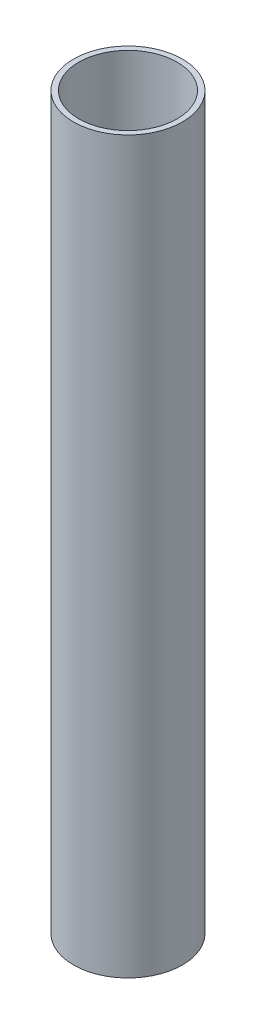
ISO-10303-21;
HEADER;
FILE_DESCRIPTION(('STEP AP214'),'2;1');
FILE_NAME('part.step','',(''),(''),'','','');
FILE_SCHEMA(('AUTOMOTIVE_DESIGN { 1 0 10303 214 1 1 1 1 }'));
ENDSEC;
DATA;
#1=APPLICATION_CONTEXT('core data for automotive mechanical design processes');
#2=APPLICATION_PROTOCOL_DEFINITION('international standard','automotive_design',2000,#1);
#3=PRODUCT_CONTEXT('',#1,'mechanical');
#4=PRODUCT('Part','Part','',(#3));
#5=PRODUCT_RELATED_PRODUCT_CATEGORY('part','',(#4));
#6=PRODUCT_DEFINITION_FORMATION('','',#4);
#7=PRODUCT_DEFINITION_CONTEXT('part definition',#1,'design');
#8=PRODUCT_DEFINITION('design','',#6,#7);
#9=PRODUCT_DEFINITION_SHAPE('','',#8);
#10=(LENGTH_UNIT() NAMED_UNIT(*) SI_UNIT(.MILLI.,.METRE.));
#11=(NAMED_UNIT(*) PLANE_ANGLE_UNIT() SI_UNIT($,.RADIAN.));
#12=(NAMED_UNIT(*) SI_UNIT($,.STERADIAN.) SOLID_ANGLE_UNIT());
#13=UNCERTAINTY_MEASURE_WITH_UNIT(LENGTH_MEASURE(1.E-05),#10,'distance_accuracy_value','');
#14=(GEOMETRIC_REPRESENTATION_CONTEXT(3) GLOBAL_UNCERTAINTY_ASSIGNED_CONTEXT((#13)) GLOBAL_UNIT_ASSIGNED_CONTEXT((#10,
#11,#12)) REPRESENTATION_CONTEXT('',''));
#15=CARTESIAN_POINT('',(0.,0.,0.));
#16=DIRECTION('',(0.,0.,1.));
#17=DIRECTION('',(1.,0.,0.));
#18=AXIS2_PLACEMENT_3D('',#15,#16,#17);
#19=CARTESIAN_POINT('',(0.,215.9,0.));
#20=DIRECTION('',(0.,1.,0.));
#21=DIRECTION('',(0.,0.,1.));
#22=AXIS2_PLACEMENT_3D('',#19,#20,#21);
#23=PLANE('',#22);
#24=CARTESIAN_POINT('',(0.,215.9,0.));
#25=DIRECTION('',(0.,1.,0.));
#26=DIRECTION('',(0.,0.,1.));
#27=AXIS2_PLACEMENT_3D('',#24,#25,#26);
#28=CIRCLE('',#27,16.1163);
#29=CARTESIAN_POINT('',(0.,215.9,16.1163));
#30=VERTEX_POINT('',#29);
#31=EDGE_CURVE('E11',#30,#30,#28,.T.);
#32=ORIENTED_EDGE('',*,*,#31,.T.);
#33=EDGE_LOOP('',(#32));
#34=FACE_BOUND('',#33,.T.);
#35=CARTESIAN_POINT('',(0.,215.9,0.));
#36=DIRECTION('',(0.,1.,0.));
#37=DIRECTION('',(1.,0.,0.));
#38=AXIS2_PLACEMENT_3D('',#35,#36,#37);
#39=CIRCLE('',#38,14.5415);
#40=CARTESIAN_POINT('',(14.5415,215.9,0.));
#41=VERTEX_POINT('',#40);
#42=EDGE_CURVE('E48',#41,#41,#39,.T.);
#43=ORIENTED_EDGE('',*,*,#42,.F.);
#44=EDGE_LOOP('',(#43));
#45=FACE_BOUND('',#44,.T.);
#46=ADVANCED_FACE('F37',(#34,#45),#23,.T.);
#47=CARTESIAN_POINT('',(0.,0.,0.));
#48=DIRECTION('',(0.,1.,0.));
#49=DIRECTION('',(0.,0.,1.));
#50=AXIS2_PLACEMENT_3D('',#47,#48,#49);
#51=PLANE('',#50);
#52=CARTESIAN_POINT('',(0.,0.,0.));
#53=DIRECTION('',(0.,1.,0.));
#54=DIRECTION('',(0.,0.,1.));
#55=AXIS2_PLACEMENT_3D('',#52,#53,#54);
#56=CIRCLE('',#55,16.1163);
#57=CARTESIAN_POINT('',(0.,0.,16.1163));
#58=VERTEX_POINT('',#57);
#59=EDGE_CURVE('E41',#58,#58,#56,.T.);
#60=ORIENTED_EDGE('',*,*,#59,.F.);
#61=EDGE_LOOP('',(#60));
#62=FACE_BOUND('',#61,.T.);
#63=CARTESIAN_POINT('',(0.,0.,0.));
#64=DIRECTION('',(0.,1.,0.));
#65=DIRECTION('',(1.,0.,0.));
#66=AXIS2_PLACEMENT_3D('',#63,#64,#65);
#67=CIRCLE('',#66,14.5415);
#68=CARTESIAN_POINT('',(14.5415,0.,0.));
#69=VERTEX_POINT('',#68);
#70=EDGE_CURVE('E50',#69,#69,#67,.T.);
#71=ORIENTED_EDGE('',*,*,#70,.T.);
#72=EDGE_LOOP('',(#71));
#73=FACE_BOUND('',#72,.T.);
#74=ADVANCED_FACE('F60',(#62,#73),#51,.F.);
#75=CARTESIAN_POINT('',(0.,215.9,0.));
#76=DIRECTION('',(0.,-1.,0.));
#77=DIRECTION('',(0.,0.,-1.));
#78=AXIS2_PLACEMENT_3D('',#75,#76,#77);
#79=CYLINDRICAL_SURFACE('',#78,16.1163);
#80=ORIENTED_EDGE('',*,*,#31,.F.);
#81=EDGE_LOOP('',(#80));
#82=FACE_BOUND('',#81,.T.);
#83=ORIENTED_EDGE('',*,*,#59,.T.);
#84=EDGE_LOOP('',(#83));
#85=FACE_BOUND('',#84,.T.);
#86=ADVANCED_FACE('F39',(#82,#85),#79,.T.);
#87=CARTESIAN_POINT('',(0.,215.9,0.));
#88=DIRECTION('',(0.,-1.,0.));
#89=DIRECTION('',(0.,0.,-1.));
#90=AXIS2_PLACEMENT_3D('',#87,#88,#89);
#91=CYLINDRICAL_SURFACE('',#90,14.5415);
#92=ORIENTED_EDGE('',*,*,#42,.T.);
#93=EDGE_LOOP('',(#92));
#94=FACE_BOUND('',#93,.T.);
#95=ORIENTED_EDGE('',*,*,#70,.F.);
#96=EDGE_LOOP('',(#95));
#97=FACE_BOUND('',#96,.T.);
#98=ADVANCED_FACE('F56',(#94,#97),#91,.F.);
#99=CLOSED_SHELL('',(#46,#74,#86,#98));
#100=MANIFOLD_SOLID_BREP('B2',#99);
#101=ADVANCED_BREP_SHAPE_REPRESENTATION('',(#18,#100),#14);
#102=SHAPE_DEFINITION_REPRESENTATION(#9,#101);
ENDSEC;
END-ISO-10303-21;
